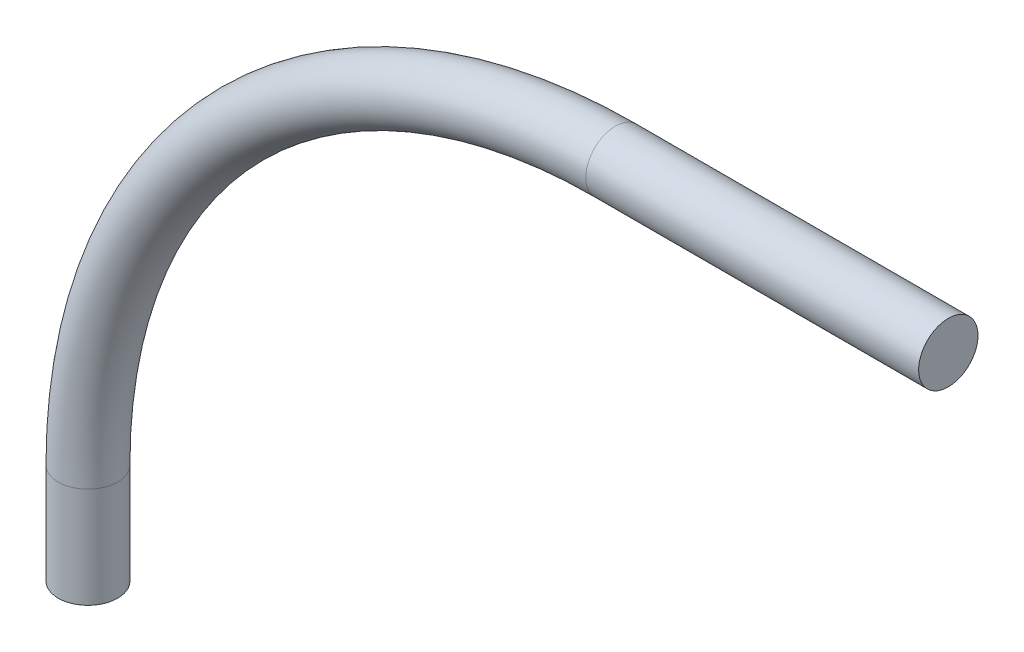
ISO-10303-21;
HEADER;
FILE_DESCRIPTION(('STEP AP214'),'2;1');
FILE_NAME('part.step','',(''),(''),'','','');
FILE_SCHEMA(('AUTOMOTIVE_DESIGN { 1 0 10303 214 1 1 1 1 }'));
ENDSEC;
DATA;
#1=APPLICATION_CONTEXT('core data for automotive mechanical design processes');
#2=APPLICATION_PROTOCOL_DEFINITION('international standard','automotive_design',2000,#1);
#3=PRODUCT_CONTEXT('',#1,'mechanical');
#4=PRODUCT('Part','Part','',(#3));
#5=PRODUCT_RELATED_PRODUCT_CATEGORY('part','',(#4));
#6=PRODUCT_DEFINITION_FORMATION('','',#4);
#7=PRODUCT_DEFINITION_CONTEXT('part definition',#1,'design');
#8=PRODUCT_DEFINITION('design','',#6,#7);
#9=PRODUCT_DEFINITION_SHAPE('','',#8);
#10=(LENGTH_UNIT() NAMED_UNIT(*) SI_UNIT(.MILLI.,.METRE.));
#11=(NAMED_UNIT(*) PLANE_ANGLE_UNIT() SI_UNIT($,.RADIAN.));
#12=(NAMED_UNIT(*) SI_UNIT($,.STERADIAN.) SOLID_ANGLE_UNIT());
#13=UNCERTAINTY_MEASURE_WITH_UNIT(LENGTH_MEASURE(1.E-05),#10,'distance_accuracy_value','');
#14=(GEOMETRIC_REPRESENTATION_CONTEXT(3) GLOBAL_UNCERTAINTY_ASSIGNED_CONTEXT((#13)) GLOBAL_UNIT_ASSIGNED_CONTEXT((#10,
#11,#12)) REPRESENTATION_CONTEXT('',''));
#15=CARTESIAN_POINT('',(0.,0.,0.));
#16=DIRECTION('',(0.,0.,1.));
#17=DIRECTION('',(1.,0.,0.));
#18=AXIS2_PLACEMENT_3D('',#15,#16,#17);
#19=CARTESIAN_POINT('',(225.5,727.5,-3.96099819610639E-13));
#20=DIRECTION('',(1.,0.,0.));
#21=DIRECTION('',(0.,1.,0.));
#22=AXIS2_PLACEMENT_3D('',#19,#20,#21);
#23=CYLINDRICAL_SURFACE('',#22,21.25);
#24=CARTESIAN_POINT('',(225.5,727.5,-3.96099819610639E-13));
#25=DIRECTION('',(-1.,0.,0.));
#26=DIRECTION('',(0.,-1.,0.));
#27=AXIS2_PLACEMENT_3D('',#24,#25,#26);
#28=CIRCLE('',#27,21.25);
#29=CARTESIAN_POINT('',(225.5,748.75,-3.96099819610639E-13));
#30=VERTEX_POINT('',#29);
#31=EDGE_CURVE('E35',#30,#30,#28,.T.);
#32=ORIENTED_EDGE('',*,*,#31,.F.);
#33=EDGE_LOOP('',(#32));
#34=FACE_BOUND('',#33,.T.);
#35=CARTESIAN_POINT('',(463.75,727.5,-3.96099819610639E-13));
#36=DIRECTION('',(-1.,0.,0.));
#37=DIRECTION('',(0.,-1.,0.));
#38=AXIS2_PLACEMENT_3D('',#35,#36,#37);
#39=CIRCLE('',#38,21.25);
#40=CARTESIAN_POINT('',(463.75,706.25,-3.96099819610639E-13));
#41=VERTEX_POINT('',#40);
#42=EDGE_CURVE('E10',#41,#41,#39,.T.);
#43=ORIENTED_EDGE('',*,*,#42,.T.);
#44=EDGE_LOOP('',(#43));
#45=FACE_BOUND('',#44,.T.);
#46=ADVANCED_FACE('F29',(#34,#45),#23,.T.);
#47=CARTESIAN_POINT('',(225.5,350.,-3.96099819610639E-13));
#48=DIRECTION('',(0.,0.,-1.));
#49=DIRECTION('',(-1.,0.,0.));
#50=AXIS2_PLACEMENT_3D('',#47,#48,#49);
#51=TOROIDAL_SURFACE('',#50,377.5,21.25);
#52=CARTESIAN_POINT('',(-152.,350.,-3.96099819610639E-13));
#53=DIRECTION('',(0.,-1.,0.));
#54=DIRECTION('',(1.,0.,0.));
#55=AXIS2_PLACEMENT_3D('',#52,#53,#54);
#56=CIRCLE('',#55,21.25);
#57=CARTESIAN_POINT('',(-173.25,350.,-3.96099819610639E-13));
#58=VERTEX_POINT('',#57);
#59=EDGE_CURVE('E39',#58,#58,#56,.T.);
#60=CARTESIAN_POINT('',(225.5,350.,-3.96099819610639E-13));
#61=DIRECTION('',(0.,0.,-1.));
#62=DIRECTION('',(-1.,0.,0.));
#63=AXIS2_PLACEMENT_3D('',#60,#61,#62);
#64=CIRCLE('',#63,398.75);
#65=EDGE_CURVE('',#58,#30,#64,.T.);
#66=ORIENTED_EDGE('',*,*,#59,.F.);
#67=ORIENTED_EDGE('',*,*,#31,.T.);
#68=ORIENTED_EDGE('',*,*,#65,.T.);
#69=ORIENTED_EDGE('',*,*,#65,.F.);
#70=EDGE_LOOP('',(#66,#68,#67,#69));
#71=FACE_BOUND('',#70,.T.);
#72=ADVANCED_FACE('F54',(#71),#51,.T.);
#73=CARTESIAN_POINT('',(-152.,350.,-3.96099819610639E-13));
#74=DIRECTION('',(0.,-1.,0.));
#75=DIRECTION('',(0.,0.,-1.));
#76=AXIS2_PLACEMENT_3D('',#73,#74,#75);
#77=CYLINDRICAL_SURFACE('',#76,21.25);
#78=ORIENTED_EDGE('',*,*,#59,.T.);
#79=EDGE_LOOP('',(#78));
#80=FACE_BOUND('',#79,.T.);
#81=CARTESIAN_POINT('',(-152.,278.,-3.96099819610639E-13));
#82=DIRECTION('',(0.,-1.,0.));
#83=DIRECTION('',(1.,0.,0.));
#84=AXIS2_PLACEMENT_3D('',#81,#82,#83);
#85=CIRCLE('',#84,21.25);
#86=CARTESIAN_POINT('',(-130.75,278.,-3.96099819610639E-13));
#87=VERTEX_POINT('',#86);
#88=EDGE_CURVE('E43',#87,#87,#85,.T.);
#89=ORIENTED_EDGE('',*,*,#88,.F.);
#90=EDGE_LOOP('',(#89));
#91=FACE_BOUND('',#90,.T.);
#92=ADVANCED_FACE('F51',(#80,#91),#77,.T.);
#93=CARTESIAN_POINT('',(463.75,727.5,-3.96099819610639E-13));
#94=DIRECTION('',(-1.,0.,0.));
#95=DIRECTION('',(0.,-1.,0.));
#96=AXIS2_PLACEMENT_3D('',#93,#94,#95);
#97=PLANE('',#96);
#98=ORIENTED_EDGE('',*,*,#42,.F.);
#99=EDGE_LOOP('',(#98));
#100=FACE_BOUND('',#99,.T.);
#101=ADVANCED_FACE('F53',(#100),#97,.F.);
#102=CARTESIAN_POINT('',(-152.,278.,-3.96099819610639E-13));
#103=DIRECTION('',(0.,-1.,0.));
#104=DIRECTION('',(1.,0.,0.));
#105=AXIS2_PLACEMENT_3D('',#102,#103,#104);
#106=PLANE('',#105);
#107=ORIENTED_EDGE('',*,*,#88,.T.);
#108=EDGE_LOOP('',(#107));
#109=FACE_BOUND('',#108,.T.);
#110=ADVANCED_FACE('F49',(#109),#106,.T.);
#111=CLOSED_SHELL('',(#46,#72,#92,#101,#110));
#112=MANIFOLD_SOLID_BREP('B2',#111);
#113=ADVANCED_BREP_SHAPE_REPRESENTATION('',(#18,#112),#14);
#114=SHAPE_DEFINITION_REPRESENTATION(#9,#113);
ENDSEC;
END-ISO-10303-21;
